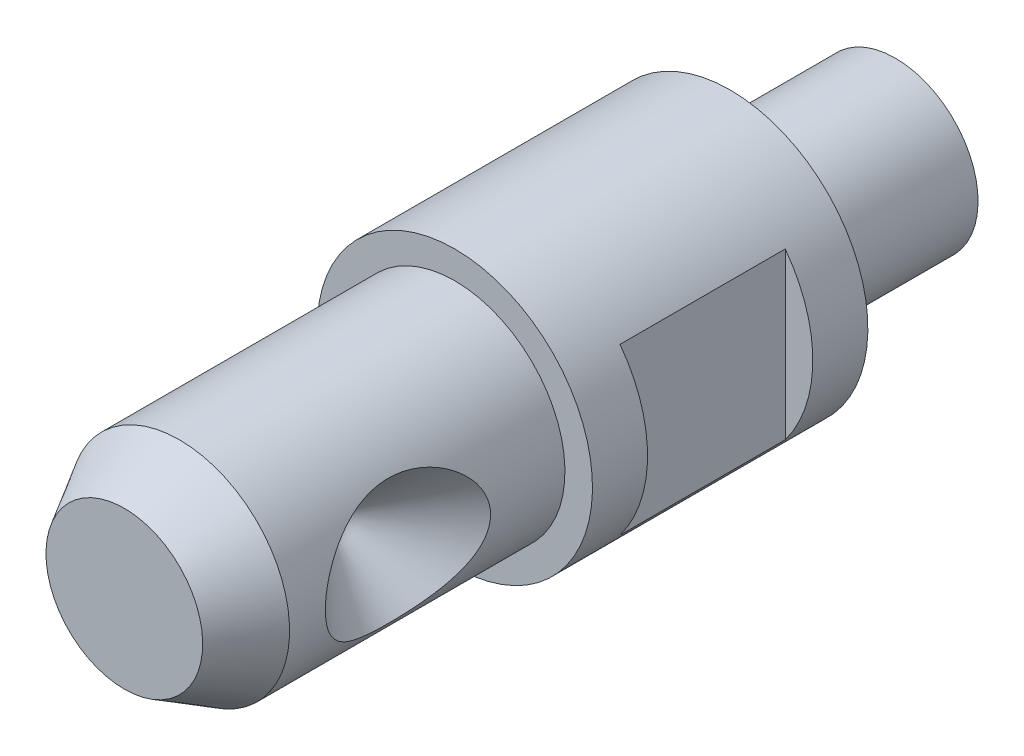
ISO-10303-21;
HEADER;
FILE_DESCRIPTION(('STEP AP214'),'2;1');
FILE_NAME('part.step','',(''),(''),'','','');
FILE_SCHEMA(('AUTOMOTIVE_DESIGN { 1 0 10303 214 1 1 1 1 }'));
ENDSEC;
DATA;
#1=APPLICATION_CONTEXT('core data for automotive mechanical design processes');
#2=APPLICATION_PROTOCOL_DEFINITION('international standard','automotive_design',2000,#1);
#3=PRODUCT_CONTEXT('',#1,'mechanical');
#4=PRODUCT('Part','Part','',(#3));
#5=PRODUCT_RELATED_PRODUCT_CATEGORY('part','',(#4));
#6=PRODUCT_DEFINITION_FORMATION('','',#4);
#7=PRODUCT_DEFINITION_CONTEXT('part definition',#1,'design');
#8=PRODUCT_DEFINITION('design','',#6,#7);
#9=PRODUCT_DEFINITION_SHAPE('','',#8);
#10=(LENGTH_UNIT() NAMED_UNIT(*) SI_UNIT(.MILLI.,.METRE.));
#11=(NAMED_UNIT(*) PLANE_ANGLE_UNIT() SI_UNIT($,.RADIAN.));
#12=(NAMED_UNIT(*) SI_UNIT($,.STERADIAN.) SOLID_ANGLE_UNIT());
#13=UNCERTAINTY_MEASURE_WITH_UNIT(LENGTH_MEASURE(1.E-05),#10,'distance_accuracy_value','');
#14=(GEOMETRIC_REPRESENTATION_CONTEXT(3) GLOBAL_UNCERTAINTY_ASSIGNED_CONTEXT((#13)) GLOBAL_UNIT_ASSIGNED_CONTEXT((#10,
#11,#12)) REPRESENTATION_CONTEXT('',''));
#15=CARTESIAN_POINT('',(0.,0.,0.));
#16=DIRECTION('',(0.,0.,1.));
#17=DIRECTION('',(1.,0.,0.));
#18=AXIS2_PLACEMENT_3D('',#15,#16,#17);
#19=CARTESIAN_POINT('',(0.,0.,0.));
#20=DIRECTION('',(0.,0.,-1.));
#21=DIRECTION('',(0.,1.,0.));
#22=AXIS2_PLACEMENT_3D('',#19,#20,#21);
#23=PLANE('',#22);
#24=CARTESIAN_POINT('',(0.,0.,0.));
#25=DIRECTION('',(0.,0.,-1.));
#26=DIRECTION('',(0.,1.,0.));
#27=AXIS2_PLACEMENT_3D('',#24,#25,#26);
#28=CIRCLE('',#27,5.);
#29=CARTESIAN_POINT('',(0.,5.,0.));
#30=VERTEX_POINT('',#29);
#31=EDGE_CURVE('E86',#30,#30,#28,.T.);
#32=ORIENTED_EDGE('',*,*,#31,.T.);
#33=EDGE_LOOP('',(#32));
#34=FACE_BOUND('',#33,.T.);
#35=CARTESIAN_POINT('',(0.,0.,0.));
#36=DIRECTION('',(0.,0.,-1.));
#37=DIRECTION('',(0.,1.,0.));
#38=AXIS2_PLACEMENT_3D('',#35,#36,#37);
#39=CIRCLE('',#38,3.);
#40=CARTESIAN_POINT('',(0.,3.,0.));
#41=VERTEX_POINT('',#40);
#42=EDGE_CURVE('E177',#41,#41,#39,.T.);
#43=ORIENTED_EDGE('',*,*,#42,.F.);
#44=EDGE_LOOP('',(#43));
#45=FACE_BOUND('',#44,.T.);
#46=ADVANCED_FACE('F14',(#34,#45),#23,.T.);
#47=CARTESIAN_POINT('',(0.,0.,10.));
#48=DIRECTION('',(0.,0.,-1.));
#49=DIRECTION('',(0.,1.,0.));
#50=AXIS2_PLACEMENT_3D('',#47,#48,#49);
#51=PLANE('',#50);
#52=CARTESIAN_POINT('',(0.,0.,10.));
#53=DIRECTION('',(0.,0.,-1.));
#54=DIRECTION('',(0.,1.,0.));
#55=AXIS2_PLACEMENT_3D('',#52,#53,#54);
#56=CIRCLE('',#55,5.);
#57=CARTESIAN_POINT('',(0.,5.,10.));
#58=VERTEX_POINT('',#57);
#59=EDGE_CURVE('E81',#58,#58,#56,.T.);
#60=ORIENTED_EDGE('',*,*,#59,.F.);
#61=EDGE_LOOP('',(#60));
#62=FACE_BOUND('',#61,.T.);
#63=CARTESIAN_POINT('',(0.,0.,10.));
#64=DIRECTION('',(0.,0.,-1.));
#65=DIRECTION('',(0.,1.,0.));
#66=AXIS2_PLACEMENT_3D('',#63,#64,#65);
#67=CIRCLE('',#66,4.);
#68=CARTESIAN_POINT('',(0.,4.,10.));
#69=VERTEX_POINT('',#68);
#70=EDGE_CURVE('E78',#69,#69,#67,.F.);
#71=ORIENTED_EDGE('',*,*,#70,.F.);
#72=EDGE_LOOP('',(#71));
#73=FACE_BOUND('',#72,.T.);
#74=ADVANCED_FACE('F121',(#62,#73),#51,.F.);
#75=CARTESIAN_POINT('',(0.,0.,10.));
#76=DIRECTION('',(0.,0.,-1.));
#77=DIRECTION('',(0.,1.,0.));
#78=AXIS2_PLACEMENT_3D('',#75,#76,#77);
#79=CYLINDRICAL_SURFACE('',#78,5.);
#80=DIRECTION('',(0.,0.,-1.));
#81=VECTOR('',#80,1.);
#82=CARTESIAN_POINT('',(-4.,-3.,10.));
#83=LINE('',#82,#81);
#84=CARTESIAN_POINT('',(-4.,-3.,2.));
#85=VERTEX_POINT('',#84);
#86=CARTESIAN_POINT('',(-4.,-3.,8.));
#87=VERTEX_POINT('',#86);
#88=EDGE_CURVE('E101',#85,#87,#83,.F.);
#89=ORIENTED_EDGE('',*,*,#88,.F.);
#90=CARTESIAN_POINT('',(0.,0.,2.));
#91=DIRECTION('',(0.,0.,-1.));
#92=DIRECTION('',(-1.,0.,0.));
#93=AXIS2_PLACEMENT_3D('',#90,#91,#92);
#94=CIRCLE('',#93,5.);
#95=CARTESIAN_POINT('',(-4.,3.,2.));
#96=VERTEX_POINT('',#95);
#97=EDGE_CURVE('E97',#96,#85,#94,.F.);
#98=ORIENTED_EDGE('',*,*,#97,.F.);
#99=DIRECTION('',(0.,0.,-1.));
#100=VECTOR('',#99,1.);
#101=CARTESIAN_POINT('',(-4.,3.,10.));
#102=LINE('',#101,#100);
#103=CARTESIAN_POINT('',(-4.,3.,8.));
#104=VERTEX_POINT('',#103);
#105=EDGE_CURVE('E95',#104,#96,#102,.T.);
#106=ORIENTED_EDGE('',*,*,#105,.F.);
#107=CARTESIAN_POINT('',(0.,0.,8.));
#108=DIRECTION('',(0.,0.,1.));
#109=DIRECTION('',(1.,0.,0.));
#110=AXIS2_PLACEMENT_3D('',#107,#108,#109);
#111=CIRCLE('',#110,5.);
#112=EDGE_CURVE('E99',#87,#104,#111,.F.);
#113=ORIENTED_EDGE('',*,*,#112,.F.);
#114=EDGE_LOOP('',(#89,#98,#106,#113));
#115=FACE_BOUND('',#114,.T.);
#116=CARTESIAN_POINT('',(0.,0.,8.));
#117=DIRECTION('',(0.,0.,1.));
#118=DIRECTION('',(0.,-1.,0.));
#119=AXIS2_PLACEMENT_3D('',#116,#117,#118);
#120=CIRCLE('',#119,5.);
#121=CARTESIAN_POINT('',(4.,3.,8.));
#122=VERTEX_POINT('',#121);
#123=CARTESIAN_POINT('',(4.,-3.,8.));
#124=VERTEX_POINT('',#123);
#125=EDGE_CURVE('E42',#122,#124,#120,.F.);
#126=ORIENTED_EDGE('',*,*,#125,.F.);
#127=DIRECTION('',(0.,0.,-1.));
#128=VECTOR('',#127,1.);
#129=CARTESIAN_POINT('',(4.,3.,10.));
#130=LINE('',#129,#128);
#131=CARTESIAN_POINT('',(4.,3.,2.));
#132=VERTEX_POINT('',#131);
#133=EDGE_CURVE('E92',#132,#122,#130,.F.);
#134=ORIENTED_EDGE('',*,*,#133,.F.);
#135=CARTESIAN_POINT('',(0.,0.,2.));
#136=DIRECTION('',(0.,0.,-1.));
#137=DIRECTION('',(0.,1.,0.));
#138=AXIS2_PLACEMENT_3D('',#135,#136,#137);
#139=CIRCLE('',#138,5.);
#140=CARTESIAN_POINT('',(4.,-3.,2.));
#141=VERTEX_POINT('',#140);
#142=EDGE_CURVE('E80',#141,#132,#139,.F.);
#143=ORIENTED_EDGE('',*,*,#142,.F.);
#144=DIRECTION('',(0.,0.,-1.));
#145=VECTOR('',#144,1.);
#146=CARTESIAN_POINT('',(4.,-3.,10.));
#147=LINE('',#146,#145);
#148=EDGE_CURVE('E83',#124,#141,#147,.T.);
#149=ORIENTED_EDGE('',*,*,#148,.F.);
#150=EDGE_LOOP('',(#126,#134,#143,#149));
#151=FACE_BOUND('',#150,.T.);
#152=ORIENTED_EDGE('',*,*,#59,.T.);
#153=EDGE_LOOP('',(#152));
#154=FACE_BOUND('',#153,.T.);
#155=ORIENTED_EDGE('',*,*,#31,.F.);
#156=EDGE_LOOP('',(#155));
#157=FACE_BOUND('',#156,.T.);
#158=ADVANCED_FACE('F16',(#115,#151,#154,#157),#79,.T.);
#159=CARTESIAN_POINT('',(0.,0.,22.));
#160=DIRECTION('',(0.,0.,-1.));
#161=DIRECTION('',(0.,1.,0.));
#162=AXIS2_PLACEMENT_3D('',#159,#160,#161);
#163=CYLINDRICAL_SURFACE('',#162,4.);
#164=CARTESIAN_POINT('',(3.51436275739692,-1.91030219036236,17.3348594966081));
#165=CARTESIAN_POINT('',(3.5561071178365,-1.8335136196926,17.4887949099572));
#166=CARTESIAN_POINT('',(3.60106331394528,-1.74489029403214,17.6360149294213));
#167=CARTESIAN_POINT('',(3.69207026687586,-1.54299697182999,17.9121244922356));
#168=CARTESIAN_POINT('',(3.73811880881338,-1.42977358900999,18.0410479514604));
#169=CARTESIAN_POINT('',(3.80967651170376,-1.22220875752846,18.2321896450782));
#170=CARTESIAN_POINT('',(3.83670298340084,-1.13528525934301,18.3018998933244));
#171=CARTESIAN_POINT('',(3.8865014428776,-0.950886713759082,18.4275424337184));
#172=CARTESIAN_POINT('',(3.90928026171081,-0.85342901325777,18.483496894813));
#173=CARTESIAN_POINT('',(3.94509187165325,-0.666155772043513,18.5702517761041));
#174=CARTESIAN_POINT('',(3.95911502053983,-0.577759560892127,18.6036865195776));
#175=CARTESIAN_POINT('',(3.98138499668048,-0.396129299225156,18.6564398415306));
#176=CARTESIAN_POINT('',(3.98963574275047,-0.302898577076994,18.6757679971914));
#177=CARTESIAN_POINT('',(3.99950772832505,-0.113738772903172,18.6988661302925));
#178=CARTESIAN_POINT('',(4.00110049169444,-0.0177998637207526,18.702569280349));
#179=CARTESIAN_POINT('',(3.99738984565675,0.173210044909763,18.6939075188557));
#180=CARTESIAN_POINT('',(3.9920859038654,0.268280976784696,18.6815413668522));
#181=CARTESIAN_POINT('',(3.97574780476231,0.448420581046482,18.6431033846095));
#182=CARTESIAN_POINT('',(3.96511435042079,0.533735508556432,18.6179885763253));
#183=CARTESIAN_POINT('',(3.93928956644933,0.699308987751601,18.5562288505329));
#184=CARTESIAN_POINT('',(3.92409640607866,0.779565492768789,18.5195793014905));
#185=CARTESIAN_POINT('',(3.88302448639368,0.966856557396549,18.4188316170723));
#186=CARTESIAN_POINT('',(3.85534818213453,1.07078346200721,18.3496869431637));
#187=CARTESIAN_POINT('',(3.79594567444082,1.26538916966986,18.1961288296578));
#188=CARTESIAN_POINT('',(3.76420999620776,1.35603587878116,18.1116794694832));
#189=CARTESIAN_POINT('',(3.68792748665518,1.55371609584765,17.8992745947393));
#190=CARTESIAN_POINT('',(3.64280030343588,1.65530122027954,17.7664635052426));
#191=CARTESIAN_POINT('',(3.55543603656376,1.83545709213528,17.4853240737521));
#192=CARTESIAN_POINT('',(3.5132017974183,1.91400543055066,17.3369808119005));
#193=CARTESIAN_POINT('',(3.43558984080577,2.05012091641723,17.0254924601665));
#194=CARTESIAN_POINT('',(3.40036396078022,2.1072431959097,16.8621129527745));
#195=CARTESIAN_POINT('',(3.35684110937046,2.17539024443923,16.6108871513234));
#196=CARTESIAN_POINT('',(3.34388541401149,2.1951841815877,16.5261112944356));
#197=CARTESIAN_POINT('',(3.32151551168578,2.22888978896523,16.3549475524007));
#198=CARTESIAN_POINT('',(3.31210004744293,2.24280354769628,16.2685602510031));
#199=CARTESIAN_POINT('',(3.29664304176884,2.26546838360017,16.0885370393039));
#200=CARTESIAN_POINT('',(3.29088791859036,2.27378367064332,15.9948213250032));
#201=CARTESIAN_POINT('',(3.28411640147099,2.28355307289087,15.8068580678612));
#202=CARTESIAN_POINT('',(3.28310020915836,2.28500689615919,15.7126105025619));
#203=CARTESIAN_POINT('',(3.28585787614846,2.28104059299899,15.5243302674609));
#204=CARTESIAN_POINT('',(3.28963149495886,2.27562081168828,15.4302975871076));
#205=CARTESIAN_POINT('',(3.30178158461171,2.2579510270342,15.2432036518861));
#206=CARTESIAN_POINT('',(3.31015795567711,2.24570117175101,15.1501423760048));
#207=CARTESIAN_POINT('',(3.3407114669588,2.20022874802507,14.8818881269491));
#208=CARTESIAN_POINT('',(3.36851525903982,2.15806110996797,14.7087480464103));
#209=CARTESIAN_POINT('',(3.4356681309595,2.04944268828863,14.3723965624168));
#210=CARTESIAN_POINT('',(3.47503836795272,1.98294734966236,14.2092040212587));
#211=CARTESIAN_POINT('',(3.56265529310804,1.82111593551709,13.8881374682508));
#212=CARTESIAN_POINT('',(3.61127385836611,1.72438161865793,13.7310639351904));
#213=CARTESIAN_POINT('',(3.70908700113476,1.50243062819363,13.4388151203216));
#214=CARTESIAN_POINT('',(3.75827915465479,1.37730879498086,13.3035694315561));
#215=CARTESIAN_POINT('',(3.83033247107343,1.1558181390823,13.1143283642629));
#216=CARTESIAN_POINT('',(3.85564047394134,1.0691094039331,13.0499247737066));
#217=CARTESIAN_POINT('',(3.90178575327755,0.885970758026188,12.9347618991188));
#218=CARTESIAN_POINT('',(3.92263012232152,0.789556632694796,12.8839809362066));
#219=CARTESIAN_POINT('',(3.95514985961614,0.603576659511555,12.8057002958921));
#220=CARTESIAN_POINT('',(3.96773369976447,0.515169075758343,12.775845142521));
#221=CARTESIAN_POINT('',(3.98705476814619,0.33414856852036,12.7302456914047));
#222=CARTESIAN_POINT('',(3.99379552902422,0.241538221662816,12.7144928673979));
#223=CARTESIAN_POINT('',(4.0007284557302,0.0544116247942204,12.6982931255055));
#224=CARTESIAN_POINT('',(4.00089901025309,-0.0401098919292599,12.6978967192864));
#225=CARTESIAN_POINT('',(3.99461662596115,-0.227714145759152,12.7125725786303));
#226=CARTESIAN_POINT('',(3.98816242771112,-0.320796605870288,12.7276477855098));
#227=CARTESIAN_POINT('',(3.96978699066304,-0.498385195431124,12.7709861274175));
#228=CARTESIAN_POINT('',(3.95814514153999,-0.583088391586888,12.7985764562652));
#229=CARTESIAN_POINT('',(3.93048356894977,-0.747151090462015,12.8650125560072));
#230=CARTESIAN_POINT('',(3.91446203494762,-0.826508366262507,12.903862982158));
#231=CARTESIAN_POINT('',(3.87105954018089,-1.0138531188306,13.0109870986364));
#232=CARTESIAN_POINT('',(3.84183228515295,-1.11836586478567,13.0845954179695));
#233=CARTESIAN_POINT('',(3.77960819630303,-1.31343290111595,13.2471752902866));
#234=CARTESIAN_POINT('',(3.74660220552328,-1.40395197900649,13.3361844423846));
#235=CARTESIAN_POINT('',(3.66808686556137,-1.59993691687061,13.5585674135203));
#236=CARTESIAN_POINT('',(3.62217607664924,-1.69986103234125,13.6966797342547));
#237=CARTESIAN_POINT('',(3.53418598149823,-1.8759580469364,13.9882714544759));
#238=CARTESIAN_POINT('',(3.49210989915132,-1.95211108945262,14.1417635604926));
#239=CARTESIAN_POINT('',(3.41606220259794,-2.08238524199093,14.4630624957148));
#240=CARTESIAN_POINT('',(3.3822418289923,-2.13610643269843,14.6310695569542));
#241=CARTESIAN_POINT('',(3.34173076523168,-2.1985052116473,14.8888660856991));
#242=CARTESIAN_POINT('',(3.32992976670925,-2.21627502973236,14.9757701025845));
#243=CARTESIAN_POINT('',(3.31015224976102,-2.24571004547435,15.1510251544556));
#244=CARTESIAN_POINT('',(3.30217429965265,-2.25737752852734,15.2393756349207));
#245=CARTESIAN_POINT('',(3.29008633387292,-2.27496182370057,15.4211814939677));
#246=CARTESIAN_POINT('',(3.28617875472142,-2.2805781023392,15.5146795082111));
#247=CARTESIAN_POINT('',(3.28309570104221,-2.28501420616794,15.7019194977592));
#248=CARTESIAN_POINT('',(3.28392047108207,-2.28383368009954,15.7956614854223));
#249=CARTESIAN_POINT('',(3.29026632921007,-2.27468229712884,15.9826465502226));
#250=CARTESIAN_POINT('',(3.29578693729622,-2.26671213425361,16.0758896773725));
#251=CARTESIAN_POINT('',(3.31126432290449,-2.24403876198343,16.2611522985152));
#252=CARTESIAN_POINT('',(3.32122074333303,-2.22933609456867,16.3531718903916));
#253=CARTESIAN_POINT('',(3.3536426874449,-2.18047848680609,16.5999234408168));
#254=CARTESIAN_POINT('',(3.37997406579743,-2.13992107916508,16.7529383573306));
#255=CARTESIAN_POINT('',(3.44144194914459,-2.03958648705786,17.0507606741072));
#256=CARTESIAN_POINT('',(3.47658728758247,-1.979790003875,17.1955596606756));
#257=CARTESIAN_POINT('',(3.51436275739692,-1.91030219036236,17.3348594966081));
#258=B_SPLINE_CURVE_WITH_KNOTS('',3,(#164,#165,#166,#167,#168,#169,#170,#171,#172,#173,#174,
#175,#176,#177,#178,#179,#180,#181,#182,#183,#184,#185,#186,#187,#188,#189,#190,#191,#192,#193,
#194,#195,#196,#197,#198,#199,#200,#201,#202,#203,#204,#205,#206,#207,#208,#209,#210,#211,#212,
#213,#214,#215,#216,#217,#218,#219,#220,#221,#222,#223,#224,#225,#226,#227,#228,#229,#230,#231,
#232,#233,#234,#235,#236,#237,#238,#239,#240,#241,#242,#243,#244,#245,#246,#247,#248,#249,#250,
#251,#252,#253,#254,#255,#256,#257),.UNSPECIFIED.,.T.,.F.,(4,2,2,2,2,2,2,2,2,2,2,2,2,2,2,2,2,2,
2,2,2,2,2,2,2,2,2,2,2,2,2,2,2,2,2,2,2,2,2,2,2,2,2,2,2,2,4),(0.,0.530571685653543,
1.06014664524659,1.40300195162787,1.74530103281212,2.03074546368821,2.31599592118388,
2.60246515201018,2.88895649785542,3.15656593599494,3.42428296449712,3.80572800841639,
4.18808019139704,4.70489972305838,5.22222033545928,5.74975482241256,6.01356911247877,
6.2772896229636,6.55970104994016,6.84212449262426,7.12453375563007,7.4069368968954,
7.94544572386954,8.48494578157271,9.05444851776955,9.62207590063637,9.95380959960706,
10.2850122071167,10.5662923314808,10.8474022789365,11.1294367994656,11.4115249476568,
11.6799755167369,11.9485372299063,12.3397401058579,12.73191188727,13.2587566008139,
13.786040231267,14.3223597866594,14.5905644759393,14.8586686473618,15.1395488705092,
15.4204436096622,15.7013096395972,15.9821530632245,16.4617974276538,16.9419244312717),.UNSPECIFIED.);
#259=CARTESIAN_POINT('',(3.51436275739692,-1.91030219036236,17.3348594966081));
#260=VERTEX_POINT('',#259);
#261=EDGE_CURVE('E9',#260,#260,#258,.T.);
#262=ORIENTED_EDGE('',*,*,#261,.T.);
#263=EDGE_LOOP('',(#262));
#264=FACE_BOUND('',#263,.T.);
#265=CARTESIAN_POINT('',(0.,0.,20.));
#266=DIRECTION('',(0.,0.,1.));
#267=DIRECTION('',(0.,-1.,0.));
#268=AXIS2_PLACEMENT_3D('',#265,#266,#267);
#269=CIRCLE('',#268,4.);
#270=CARTESIAN_POINT('',(0.,-4.,20.));
#271=VERTEX_POINT('',#270);
#272=EDGE_CURVE('E27',#271,#271,#269,.F.);
#273=ORIENTED_EDGE('',*,*,#272,.T.);
#274=EDGE_LOOP('',(#273));
#275=FACE_BOUND('',#274,.T.);
#276=ORIENTED_EDGE('',*,*,#70,.T.);
#277=EDGE_LOOP('',(#276));
#278=FACE_BOUND('',#277,.T.);
#279=ADVANCED_FACE('F69',(#264,#275,#278),#163,.T.);
#280=CARTESIAN_POINT('',(0.,0.,22.));
#281=DIRECTION('',(0.,0.,1.));
#282=DIRECTION('',(0.,-1.,0.));
#283=AXIS2_PLACEMENT_3D('',#280,#281,#282);
#284=PLANE('',#283);
#285=CARTESIAN_POINT('',(0.,0.,22.));
#286=DIRECTION('',(0.,0.,1.));
#287=DIRECTION('',(0.,-1.,0.));
#288=AXIS2_PLACEMENT_3D('',#285,#286,#287);
#289=CIRCLE('',#288,2.84529946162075);
#290=CARTESIAN_POINT('',(0.,-2.84529946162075,22.));
#291=VERTEX_POINT('',#290);
#292=EDGE_CURVE('E103',#291,#291,#289,.T.);
#293=ORIENTED_EDGE('',*,*,#292,.T.);
#294=EDGE_LOOP('',(#293));
#295=FACE_BOUND('',#294,.T.);
#296=ADVANCED_FACE('F72',(#295),#284,.T.);
#297=CARTESIAN_POINT('',(0.,0.,-6.));
#298=DIRECTION('',(0.,0.,1.));
#299=DIRECTION('',(0.,-1.,0.));
#300=AXIS2_PLACEMENT_3D('',#297,#298,#299);
#301=CYLINDRICAL_SURFACE('',#300,3.);
#302=CARTESIAN_POINT('',(0.,0.,-6.));
#303=DIRECTION('',(0.,0.,-1.));
#304=DIRECTION('',(0.,1.,0.));
#305=AXIS2_PLACEMENT_3D('',#302,#303,#304);
#306=CIRCLE('',#305,3.);
#307=CARTESIAN_POINT('',(0.,3.,-6.));
#308=VERTEX_POINT('',#307);
#309=EDGE_CURVE('E182',#308,#308,#306,.T.);
#310=ORIENTED_EDGE('',*,*,#309,.F.);
#311=EDGE_LOOP('',(#310));
#312=FACE_BOUND('',#311,.T.);
#313=ORIENTED_EDGE('',*,*,#42,.T.);
#314=EDGE_LOOP('',(#313));
#315=FACE_BOUND('',#314,.T.);
#316=ADVANCED_FACE('F135',(#312,#315),#301,.T.);
#317=CARTESIAN_POINT('',(0.,0.,-6.));
#318=DIRECTION('',(0.,0.,-1.));
#319=DIRECTION('',(0.,1.,0.));
#320=AXIS2_PLACEMENT_3D('',#317,#318,#319);
#321=PLANE('',#320);
#322=ORIENTED_EDGE('',*,*,#309,.T.);
#323=EDGE_LOOP('',(#322));
#324=FACE_BOUND('',#323,.T.);
#325=ADVANCED_FACE('F138',(#324),#321,.T.);
#326=CARTESIAN_POINT('',(4.,-13.,8.));
#327=DIRECTION('',(0.,0.,1.));
#328=DIRECTION('',(0.,-1.,0.));
#329=AXIS2_PLACEMENT_3D('',#326,#327,#328);
#330=PLANE('',#329);
#331=DIRECTION('',(0.,1.,0.));
#332=VECTOR('',#331,1.);
#333=CARTESIAN_POINT('',(4.,-13.,8.));
#334=LINE('',#333,#332);
#335=EDGE_CURVE('E174',#124,#122,#334,.T.);
#336=ORIENTED_EDGE('',*,*,#335,.T.);
#337=ORIENTED_EDGE('',*,*,#125,.T.);
#338=EDGE_LOOP('',(#336,#337));
#339=FACE_BOUND('',#338,.T.);
#340=ADVANCED_FACE('F142',(#339),#330,.F.);
#341=CARTESIAN_POINT('',(4.,-13.,2.));
#342=DIRECTION('',(-1.,0.,0.));
#343=DIRECTION('',(0.,0.,1.));
#344=AXIS2_PLACEMENT_3D('',#341,#342,#343);
#345=PLANE('',#344);
#346=ORIENTED_EDGE('',*,*,#133,.T.);
#347=ORIENTED_EDGE('',*,*,#335,.F.);
#348=ORIENTED_EDGE('',*,*,#148,.T.);
#349=DIRECTION('',(0.,1.,0.));
#350=VECTOR('',#349,1.);
#351=CARTESIAN_POINT('',(4.,-13.,2.));
#352=LINE('',#351,#350);
#353=EDGE_CURVE('E170',#141,#132,#352,.T.);
#354=ORIENTED_EDGE('',*,*,#353,.T.);
#355=EDGE_LOOP('',(#346,#347,#348,#354));
#356=FACE_BOUND('',#355,.T.);
#357=ADVANCED_FACE('F148',(#356),#345,.F.);
#358=CARTESIAN_POINT('',(4.,-13.,2.));
#359=DIRECTION('',(0.,0.,-1.));
#360=DIRECTION('',(0.,1.,0.));
#361=AXIS2_PLACEMENT_3D('',#358,#359,#360);
#362=PLANE('',#361);
#363=ORIENTED_EDGE('',*,*,#353,.F.);
#364=ORIENTED_EDGE('',*,*,#142,.T.);
#365=EDGE_LOOP('',(#363,#364));
#366=FACE_BOUND('',#365,.T.);
#367=ADVANCED_FACE('F144',(#366),#362,.F.);
#368=CARTESIAN_POINT('',(-4.,-13.,8.));
#369=DIRECTION('',(0.,0.,1.));
#370=DIRECTION('',(1.,0.,0.));
#371=AXIS2_PLACEMENT_3D('',#368,#369,#370);
#372=PLANE('',#371);
#373=DIRECTION('',(0.,1.,0.));
#374=VECTOR('',#373,1.);
#375=CARTESIAN_POINT('',(-4.,-13.,8.));
#376=LINE('',#375,#374);
#377=EDGE_CURVE('E34',#87,#104,#376,.T.);
#378=ORIENTED_EDGE('',*,*,#377,.F.);
#379=ORIENTED_EDGE('',*,*,#112,.T.);
#380=EDGE_LOOP('',(#378,#379));
#381=FACE_BOUND('',#380,.T.);
#382=ADVANCED_FACE('F147',(#381),#372,.F.);
#383=CARTESIAN_POINT('',(-4.,-13.,2.));
#384=DIRECTION('',(0.,0.,-1.));
#385=DIRECTION('',(-1.,0.,0.));
#386=AXIS2_PLACEMENT_3D('',#383,#384,#385);
#387=PLANE('',#386);
#388=ORIENTED_EDGE('',*,*,#97,.T.);
#389=DIRECTION('',(0.,1.,0.));
#390=VECTOR('',#389,1.);
#391=CARTESIAN_POINT('',(-4.,-13.,2.));
#392=LINE('',#391,#390);
#393=EDGE_CURVE('E166',#85,#96,#392,.T.);
#394=ORIENTED_EDGE('',*,*,#393,.T.);
#395=EDGE_LOOP('',(#388,#394));
#396=FACE_BOUND('',#395,.T.);
#397=ADVANCED_FACE('F117',(#396),#387,.F.);
#398=CARTESIAN_POINT('',(-4.,-13.,2.));
#399=DIRECTION('',(1.,0.,0.));
#400=DIRECTION('',(0.,0.,-1.));
#401=AXIS2_PLACEMENT_3D('',#398,#399,#400);
#402=PLANE('',#401);
#403=ORIENTED_EDGE('',*,*,#88,.T.);
#404=ORIENTED_EDGE('',*,*,#377,.T.);
#405=ORIENTED_EDGE('',*,*,#105,.T.);
#406=ORIENTED_EDGE('',*,*,#393,.F.);
#407=EDGE_LOOP('',(#403,#404,#405,#406));
#408=FACE_BOUND('',#407,.T.);
#409=ADVANCED_FACE('F109',(#408),#402,.F.);
#410=CARTESIAN_POINT('',(0.,0.,22.));
#411=DIRECTION('',(0.,0.,-1.));
#412=DIRECTION('',(0.,1.,0.));
#413=AXIS2_PLACEMENT_3D('',#410,#411,#412);
#414=CONICAL_SURFACE('',#413,2.84529946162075,0.523598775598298);
#415=ORIENTED_EDGE('',*,*,#272,.F.);
#416=EDGE_LOOP('',(#415));
#417=FACE_BOUND('',#416,.T.);
#418=ORIENTED_EDGE('',*,*,#292,.F.);
#419=EDGE_LOOP('',(#418));
#420=FACE_BOUND('',#419,.T.);
#421=ADVANCED_FACE('F66',(#417,#420),#414,.T.);
#422=CARTESIAN_POINT('',(0.999999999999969,0.,15.7));
#423=DIRECTION('',(1.,0.,0.));
#424=DIRECTION('',(0.,0.,-1.));
#425=AXIS2_PLACEMENT_3D('',#422,#423,#424);
#426=CONICAL_SURFACE('',#425,0.,0.785398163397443);
#427=CARTESIAN_POINT('',(0.999999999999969,0.,15.7));
#428=VERTEX_POINT('',#427);
#429=VERTEX_LOOP('',#428);
#430=FACE_BOUND('',#429,.T.);
#431=ORIENTED_EDGE('',*,*,#261,.F.);
#432=EDGE_LOOP('',(#431));
#433=FACE_BOUND('',#432,.T.);
#434=ADVANCED_FACE('F63',(#430,#433),#426,.F.);
#435=CLOSED_SHELL('',(#46,#74,#158,#279,#296,#316,#325,#340,#357,#367,#382,#397,#409,#421,#434));
#436=MANIFOLD_SOLID_BREP('B1',#435);
#437=ADVANCED_BREP_SHAPE_REPRESENTATION('',(#18,#436),#14);
#438=SHAPE_DEFINITION_REPRESENTATION(#9,#437);
ENDSEC;
END-ISO-10303-21;
